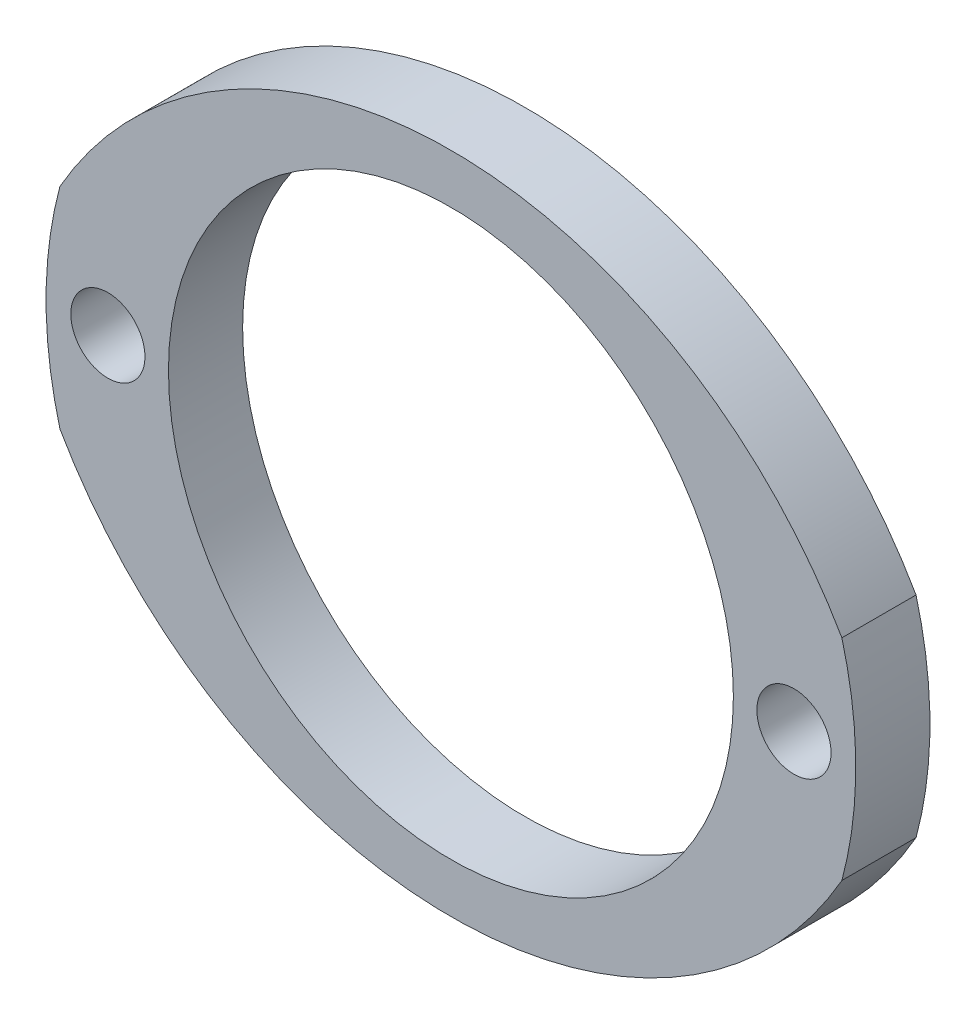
from build123d import *

# Parameters (mm, degrees)
MODEL_R             = 1.5
MODEL_R_2           = 11.425
BOSS_EXTRUDE3_DEPTH = 3


with BuildPart() as part:
    # Model → Boss-Extrude3 (new body)
    with BuildSketch(Plane.XY):
        with BuildLine():
            ThreePointArc((-102.563055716, 402.021355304), (-103.124230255, 397.771231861), (-102.563055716, 393.521108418))
            ThreePointArc((-102.563055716, 393.521108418), (-86.749230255, 384.346231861), (-70.935404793, 393.521108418))
            ThreePointArc((-70.935404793, 393.521108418), (-70.374230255, 397.771231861), (-70.935404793, 402.021355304))
            ThreePointArc((-70.935404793, 402.021355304), (-86.749230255, 411.196231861), (-102.563055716, 402.021355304))
        make_face()
        with Locations((-72.874230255, 397.771231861)):
            Circle(MODEL_R, mode=Mode.SUBTRACT)
        with Locations((-100.624230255, 397.771231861)):
            Circle(MODEL_R, mode=Mode.SUBTRACT)
        with Locations((-86.749230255, 397.771231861)):
            Circle(MODEL_R_2, mode=Mode.SUBTRACT)
    extrude(amount=BOSS_EXTRUDE3_DEPTH)


solid = part.part
